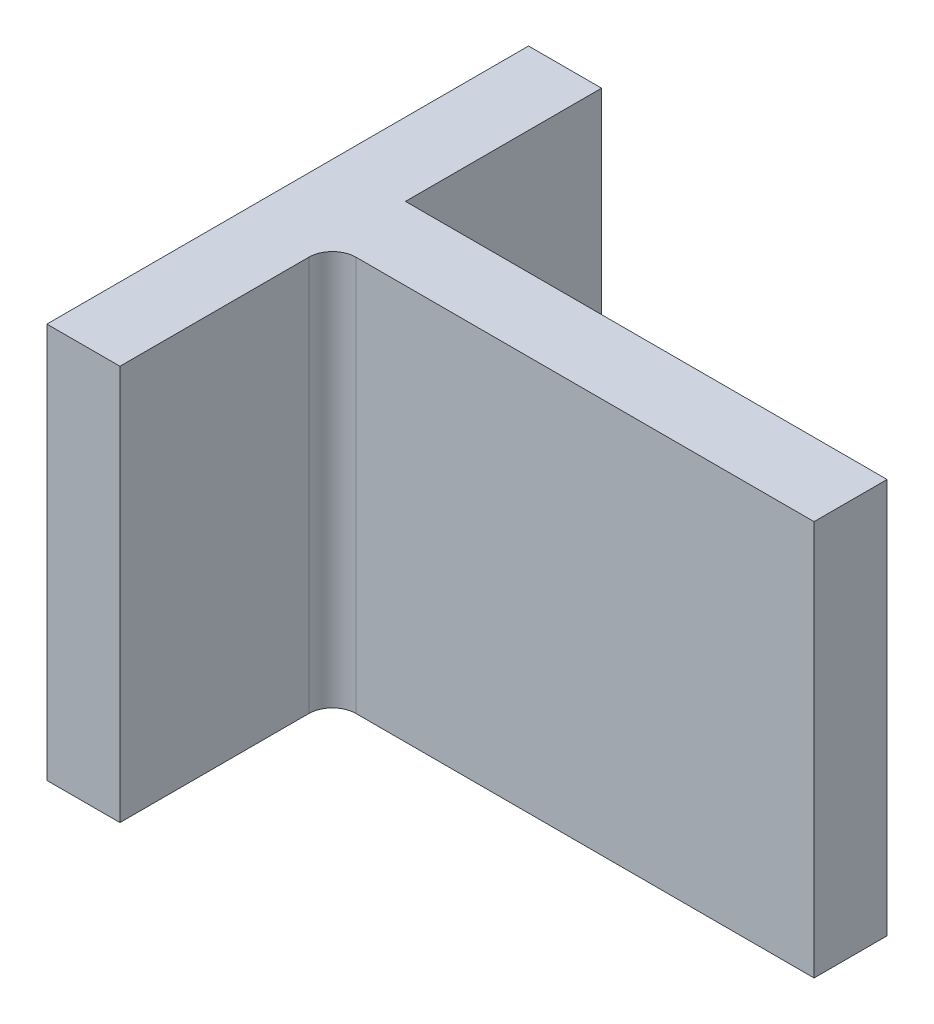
ISO-10303-21;
HEADER;
FILE_DESCRIPTION(('STEP AP214'),'2;1');
FILE_NAME('part.step','',(''),(''),'','','');
FILE_SCHEMA(('AUTOMOTIVE_DESIGN { 1 0 10303 214 1 1 1 1 }'));
ENDSEC;
DATA;
#1=APPLICATION_CONTEXT('core data for automotive mechanical design processes');
#2=APPLICATION_PROTOCOL_DEFINITION('international standard','automotive_design',2000,#1);
#3=PRODUCT_CONTEXT('',#1,'mechanical');
#4=PRODUCT('Part','Part','',(#3));
#5=PRODUCT_RELATED_PRODUCT_CATEGORY('part','',(#4));
#6=PRODUCT_DEFINITION_FORMATION('','',#4);
#7=PRODUCT_DEFINITION_CONTEXT('part definition',#1,'design');
#8=PRODUCT_DEFINITION('design','',#6,#7);
#9=PRODUCT_DEFINITION_SHAPE('','',#8);
#10=(LENGTH_UNIT() NAMED_UNIT(*) SI_UNIT(.MILLI.,.METRE.));
#11=(NAMED_UNIT(*) PLANE_ANGLE_UNIT() SI_UNIT($,.RADIAN.));
#12=(NAMED_UNIT(*) SI_UNIT($,.STERADIAN.) SOLID_ANGLE_UNIT());
#13=UNCERTAINTY_MEASURE_WITH_UNIT(LENGTH_MEASURE(1.E-05),#10,'distance_accuracy_value','');
#14=(GEOMETRIC_REPRESENTATION_CONTEXT(3) GLOBAL_UNCERTAINTY_ASSIGNED_CONTEXT((#13)) GLOBAL_UNIT_ASSIGNED_CONTEXT((#10,
#11,#12)) REPRESENTATION_CONTEXT('',''));
#15=CARTESIAN_POINT('',(0.,0.,0.));
#16=DIRECTION('',(0.,0.,1.));
#17=DIRECTION('',(1.,0.,0.));
#18=AXIS2_PLACEMENT_3D('',#15,#16,#17);
#19=CARTESIAN_POINT('',(15.469383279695,0.,102.));
#20=DIRECTION('',(-1.,0.,0.));
#21=DIRECTION('',(0.,0.,1.));
#22=AXIS2_PLACEMENT_3D('',#19,#20,#21);
#23=PLANE('',#22);
#24=DIRECTION('',(0.,0.,-1.));
#25=VECTOR('',#24,1.);
#26=CARTESIAN_POINT('',(15.469383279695,83.7000822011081,102.));
#27=LINE('',#26,#25);
#28=CARTESIAN_POINT('',(15.469383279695,83.7000822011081,41.530616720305));
#29=VERTEX_POINT('',#28);
#30=CARTESIAN_POINT('',(15.469383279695,83.7000822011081,0.));
#31=VERTEX_POINT('',#30);
#32=EDGE_CURVE('E123',#29,#31,#27,.T.);
#33=ORIENTED_EDGE('',*,*,#32,.F.);
#34=DIRECTION('',(0.,-1.,0.));
#35=VECTOR('',#34,1.);
#36=CARTESIAN_POINT('',(15.469383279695,0.,41.530616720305));
#37=LINE('',#36,#35);
#38=CARTESIAN_POINT('',(15.469383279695,0.,41.530616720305));
#39=VERTEX_POINT('',#38);
#40=EDGE_CURVE('E109',#29,#39,#37,.T.);
#41=ORIENTED_EDGE('',*,*,#40,.T.);
#42=DIRECTION('',(0.,0.,-1.));
#43=VECTOR('',#42,1.);
#44=CARTESIAN_POINT('',(15.469383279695,0.,102.));
#45=LINE('',#44,#43);
#46=CARTESIAN_POINT('',(15.469383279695,0.,0.));
#47=VERTEX_POINT('',#46);
#48=EDGE_CURVE('E121',#39,#47,#45,.T.);
#49=ORIENTED_EDGE('',*,*,#48,.T.);
#50=DIRECTION('',(0.,1.,0.));
#51=VECTOR('',#50,1.);
#52=CARTESIAN_POINT('',(15.469383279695,0.,0.));
#53=LINE('',#52,#51);
#54=EDGE_CURVE('E164',#47,#31,#53,.T.);
#55=ORIENTED_EDGE('',*,*,#54,.T.);
#56=EDGE_LOOP('',(#33,#41,#49,#55));
#57=FACE_BOUND('',#56,.T.);
#58=ADVANCED_FACE('F35',(#57),#23,.F.);
#59=CARTESIAN_POINT('',(0.,0.,102.));
#60=DIRECTION('',(1.,0.,0.));
#61=DIRECTION('',(0.,0.,-1.));
#62=AXIS2_PLACEMENT_3D('',#59,#60,#61);
#63=PLANE('',#62);
#64=DIRECTION('',(0.,-1.,0.));
#65=VECTOR('',#64,1.);
#66=CARTESIAN_POINT('',(0.,0.,0.));
#67=LINE('',#66,#65);
#68=CARTESIAN_POINT('',(0.,83.7000822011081,0.));
#69=VERTEX_POINT('',#68);
#70=CARTESIAN_POINT('',(0.,0.,0.));
#71=VERTEX_POINT('',#70);
#72=EDGE_CURVE('E116',#69,#71,#67,.T.);
#73=ORIENTED_EDGE('',*,*,#72,.T.);
#74=DIRECTION('',(0.,0.,-1.));
#75=VECTOR('',#74,1.);
#76=CARTESIAN_POINT('',(0.,0.,102.));
#77=LINE('',#76,#75);
#78=CARTESIAN_POINT('',(0.,0.,102.));
#79=VERTEX_POINT('',#78);
#80=EDGE_CURVE('E135',#79,#71,#77,.T.);
#81=ORIENTED_EDGE('',*,*,#80,.F.);
#82=DIRECTION('',(0.,-1.,0.));
#83=VECTOR('',#82,1.);
#84=CARTESIAN_POINT('',(0.,0.,102.));
#85=LINE('',#84,#83);
#86=CARTESIAN_POINT('',(0.,83.7000822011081,102.));
#87=VERTEX_POINT('',#86);
#88=EDGE_CURVE('E163',#87,#79,#85,.T.);
#89=ORIENTED_EDGE('',*,*,#88,.F.);
#90=DIRECTION('',(0.,0.,-1.));
#91=VECTOR('',#90,1.);
#92=CARTESIAN_POINT('',(0.,83.7000822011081,102.));
#93=LINE('',#92,#91);
#94=EDGE_CURVE('E150',#87,#69,#93,.T.);
#95=ORIENTED_EDGE('',*,*,#94,.T.);
#96=EDGE_LOOP('',(#73,#81,#89,#95));
#97=FACE_BOUND('',#96,.T.);
#98=ADVANCED_FACE('F211',(#97),#63,.F.);
#99=CARTESIAN_POINT('',(0.,0.,102.));
#100=DIRECTION('',(0.,1.,0.));
#101=DIRECTION('',(0.,0.,1.));
#102=AXIS2_PLACEMENT_3D('',#99,#100,#101);
#103=PLANE('',#102);
#104=DIRECTION('',(1.,0.,0.));
#105=VECTOR('',#104,1.);
#106=CARTESIAN_POINT('',(0.,0.,0.));
#107=LINE('',#106,#105);
#108=EDGE_CURVE('E129',#71,#47,#107,.T.);
#109=ORIENTED_EDGE('',*,*,#108,.T.);
#110=ORIENTED_EDGE('',*,*,#48,.F.);
#111=DIRECTION('',(1.,0.,0.));
#112=VECTOR('',#111,1.);
#113=CARTESIAN_POINT('',(15.469383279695,0.,41.530616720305));
#114=LINE('',#113,#112);
#115=CARTESIAN_POINT('',(117.469383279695,0.,41.530616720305));
#116=VERTEX_POINT('',#115);
#117=EDGE_CURVE('E105',#39,#116,#114,.T.);
#118=ORIENTED_EDGE('',*,*,#117,.T.);
#119=DIRECTION('',(0.,0.,1.));
#120=VECTOR('',#119,1.);
#121=CARTESIAN_POINT('',(117.469383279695,0.,41.530616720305));
#122=LINE('',#121,#120);
#123=CARTESIAN_POINT('',(117.469383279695,0.,57.));
#124=VERTEX_POINT('',#123);
#125=EDGE_CURVE('E177',#116,#124,#122,.T.);
#126=ORIENTED_EDGE('',*,*,#125,.T.);
#127=DIRECTION('',(1.,0.,0.));
#128=VECTOR('',#127,1.);
#129=CARTESIAN_POINT('',(15.469383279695,0.,57.));
#130=LINE('',#129,#128);
#131=CARTESIAN_POINT('',(20.469383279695,0.,57.));
#132=VERTEX_POINT('',#131);
#133=EDGE_CURVE('E117',#132,#124,#130,.T.);
#134=ORIENTED_EDGE('',*,*,#133,.F.);
#135=CARTESIAN_POINT('',(20.469383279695,0.,62.));
#136=DIRECTION('',(0.,1.,0.));
#137=DIRECTION('',(0.,0.,1.));
#138=AXIS2_PLACEMENT_3D('',#135,#136,#137);
#139=CIRCLE('',#138,5.);
#140=CARTESIAN_POINT('',(15.469383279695,0.,62.));
#141=VERTEX_POINT('',#140);
#142=EDGE_CURVE('E11',#132,#141,#139,.T.);
#143=ORIENTED_EDGE('',*,*,#142,.T.);
#144=CARTESIAN_POINT('',(15.469383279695,0.,102.));
#145=VERTEX_POINT('',#144);
#146=EDGE_CURVE('E131',#145,#141,#45,.T.);
#147=ORIENTED_EDGE('',*,*,#146,.F.);
#148=DIRECTION('',(1.,0.,0.));
#149=VECTOR('',#148,1.);
#150=CARTESIAN_POINT('',(0.,0.,102.));
#151=LINE('',#150,#149);
#152=EDGE_CURVE('E169',#79,#145,#151,.T.);
#153=ORIENTED_EDGE('',*,*,#152,.F.);
#154=ORIENTED_EDGE('',*,*,#80,.T.);
#155=EDGE_LOOP('',(#109,#110,#118,#126,#134,#143,#147,#153,#154));
#156=FACE_BOUND('',#155,.T.);
#157=ADVANCED_FACE('F127',(#156),#103,.F.);
#158=ORIENTED_EDGE('',*,*,#146,.T.);
#159=DIRECTION('',(0.,1.,0.));
#160=VECTOR('',#159,1.);
#161=CARTESIAN_POINT('',(15.469383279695,83.7000822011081,62.));
#162=LINE('',#161,#160);
#163=CARTESIAN_POINT('',(15.469383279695,83.7000822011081,62.));
#164=VERTEX_POINT('',#163);
#165=EDGE_CURVE('E149',#141,#164,#162,.T.);
#166=ORIENTED_EDGE('',*,*,#165,.T.);
#167=CARTESIAN_POINT('',(15.469383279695,83.7000822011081,102.));
#168=VERTEX_POINT('',#167);
#169=EDGE_CURVE('E132',#168,#164,#27,.T.);
#170=ORIENTED_EDGE('',*,*,#169,.F.);
#171=DIRECTION('',(0.,1.,0.));
#172=VECTOR('',#171,1.);
#173=CARTESIAN_POINT('',(15.469383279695,0.,102.));
#174=LINE('',#173,#172);
#175=EDGE_CURVE('E158',#145,#168,#174,.T.);
#176=ORIENTED_EDGE('',*,*,#175,.F.);
#177=EDGE_LOOP('',(#158,#166,#170,#176));
#178=FACE_BOUND('',#177,.T.);
#179=ADVANCED_FACE('F205',(#178),#23,.F.);
#180=CARTESIAN_POINT('',(0.,83.7000822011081,102.));
#181=DIRECTION('',(0.,-1.,0.));
#182=DIRECTION('',(0.,0.,-1.));
#183=AXIS2_PLACEMENT_3D('',#180,#181,#182);
#184=PLANE('',#183);
#185=DIRECTION('',(-1.,0.,0.));
#186=VECTOR('',#185,1.);
#187=CARTESIAN_POINT('',(0.,83.7000822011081,0.));
#188=LINE('',#187,#186);
#189=EDGE_CURVE('E161',#31,#69,#188,.T.);
#190=ORIENTED_EDGE('',*,*,#189,.T.);
#191=ORIENTED_EDGE('',*,*,#94,.F.);
#192=DIRECTION('',(-1.,0.,0.));
#193=VECTOR('',#192,1.);
#194=CARTESIAN_POINT('',(0.,83.7000822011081,102.));
#195=LINE('',#194,#193);
#196=EDGE_CURVE('E152',#168,#87,#195,.T.);
#197=ORIENTED_EDGE('',*,*,#196,.F.);
#198=ORIENTED_EDGE('',*,*,#169,.T.);
#199=CARTESIAN_POINT('',(20.469383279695,83.7000822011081,62.));
#200=DIRECTION('',(0.,-1.,0.));
#201=DIRECTION('',(0.,0.,-1.));
#202=AXIS2_PLACEMENT_3D('',#199,#200,#201);
#203=CIRCLE('',#202,5.);
#204=CARTESIAN_POINT('',(20.469383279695,83.7000822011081,57.));
#205=VERTEX_POINT('',#204);
#206=EDGE_CURVE('E43',#164,#205,#203,.T.);
#207=ORIENTED_EDGE('',*,*,#206,.T.);
#208=DIRECTION('',(1.,0.,0.));
#209=VECTOR('',#208,1.);
#210=CARTESIAN_POINT('',(15.469383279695,83.7000822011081,57.));
#211=LINE('',#210,#209);
#212=CARTESIAN_POINT('',(117.469383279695,83.7000822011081,57.));
#213=VERTEX_POINT('',#212);
#214=EDGE_CURVE('E186',#205,#213,#211,.T.);
#215=ORIENTED_EDGE('',*,*,#214,.T.);
#216=DIRECTION('',(0.,0.,-1.));
#217=VECTOR('',#216,1.);
#218=CARTESIAN_POINT('',(117.469383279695,83.7000822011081,41.530616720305));
#219=LINE('',#218,#217);
#220=CARTESIAN_POINT('',(117.469383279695,83.7000822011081,41.530616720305));
#221=VERTEX_POINT('',#220);
#222=EDGE_CURVE('E125',#213,#221,#219,.T.);
#223=ORIENTED_EDGE('',*,*,#222,.T.);
#224=DIRECTION('',(1.,0.,0.));
#225=VECTOR('',#224,1.);
#226=CARTESIAN_POINT('',(15.469383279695,83.7000822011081,41.530616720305));
#227=LINE('',#226,#225);
#228=EDGE_CURVE('E124',#29,#221,#227,.T.);
#229=ORIENTED_EDGE('',*,*,#228,.F.);
#230=ORIENTED_EDGE('',*,*,#32,.T.);
#231=EDGE_LOOP('',(#190,#191,#197,#198,#207,#215,#223,#229,#230));
#232=FACE_BOUND('',#231,.T.);
#233=ADVANCED_FACE('F199',(#232),#184,.F.);
#234=CARTESIAN_POINT('',(0.,83.7000822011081,102.));
#235=DIRECTION('',(0.,0.,-1.));
#236=DIRECTION('',(-1.,0.,0.));
#237=AXIS2_PLACEMENT_3D('',#234,#235,#236);
#238=PLANE('',#237);
#239=ORIENTED_EDGE('',*,*,#88,.T.);
#240=ORIENTED_EDGE('',*,*,#152,.T.);
#241=ORIENTED_EDGE('',*,*,#175,.T.);
#242=ORIENTED_EDGE('',*,*,#196,.T.);
#243=EDGE_LOOP('',(#239,#240,#241,#242));
#244=FACE_BOUND('',#243,.T.);
#245=ADVANCED_FACE('F209',(#244),#238,.F.);
#246=CARTESIAN_POINT('',(0.,83.7000822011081,0.));
#247=DIRECTION('',(0.,0.,-1.));
#248=DIRECTION('',(-1.,0.,0.));
#249=AXIS2_PLACEMENT_3D('',#246,#247,#248);
#250=PLANE('',#249);
#251=ORIENTED_EDGE('',*,*,#72,.F.);
#252=ORIENTED_EDGE('',*,*,#189,.F.);
#253=ORIENTED_EDGE('',*,*,#54,.F.);
#254=ORIENTED_EDGE('',*,*,#108,.F.);
#255=EDGE_LOOP('',(#251,#252,#253,#254));
#256=FACE_BOUND('',#255,.T.);
#257=ADVANCED_FACE('F214',(#256),#250,.T.);
#258=CARTESIAN_POINT('',(15.469383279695,0.,41.530616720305));
#259=DIRECTION('',(0.,0.,1.));
#260=DIRECTION('',(1.,0.,0.));
#261=AXIS2_PLACEMENT_3D('',#258,#259,#260);
#262=PLANE('',#261);
#263=DIRECTION('',(0.,-1.,0.));
#264=VECTOR('',#263,1.);
#265=CARTESIAN_POINT('',(117.469383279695,0.,41.530616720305));
#266=LINE('',#265,#264);
#267=EDGE_CURVE('E112',#221,#116,#266,.T.);
#268=ORIENTED_EDGE('',*,*,#267,.T.);
#269=ORIENTED_EDGE('',*,*,#117,.F.);
#270=ORIENTED_EDGE('',*,*,#40,.F.);
#271=ORIENTED_EDGE('',*,*,#228,.T.);
#272=EDGE_LOOP('',(#268,#269,#270,#271));
#273=FACE_BOUND('',#272,.T.);
#274=ADVANCED_FACE('F107',(#273),#262,.F.);
#275=CARTESIAN_POINT('',(15.469383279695,0.,57.));
#276=DIRECTION('',(0.,0.,-1.));
#277=DIRECTION('',(-1.,0.,0.));
#278=AXIS2_PLACEMENT_3D('',#275,#276,#277);
#279=PLANE('',#278);
#280=ORIENTED_EDGE('',*,*,#214,.F.);
#281=DIRECTION('',(0.,1.,0.));
#282=VECTOR('',#281,1.);
#283=CARTESIAN_POINT('',(20.469383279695,0.,57.));
#284=LINE('',#283,#282);
#285=EDGE_CURVE('E50',#205,#132,#284,.F.);
#286=ORIENTED_EDGE('',*,*,#285,.T.);
#287=ORIENTED_EDGE('',*,*,#133,.T.);
#288=DIRECTION('',(0.,1.,0.));
#289=VECTOR('',#288,1.);
#290=CARTESIAN_POINT('',(117.469383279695,0.,57.));
#291=LINE('',#290,#289);
#292=EDGE_CURVE('E174',#124,#213,#291,.T.);
#293=ORIENTED_EDGE('',*,*,#292,.T.);
#294=EDGE_LOOP('',(#280,#286,#287,#293));
#295=FACE_BOUND('',#294,.T.);
#296=ADVANCED_FACE('F193',(#295),#279,.F.);
#297=CARTESIAN_POINT('',(117.469383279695,83.7000822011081,41.530616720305));
#298=DIRECTION('',(1.,0.,0.));
#299=DIRECTION('',(0.,0.,-1.));
#300=AXIS2_PLACEMENT_3D('',#297,#298,#299);
#301=PLANE('',#300);
#302=ORIENTED_EDGE('',*,*,#267,.F.);
#303=ORIENTED_EDGE('',*,*,#222,.F.);
#304=ORIENTED_EDGE('',*,*,#292,.F.);
#305=ORIENTED_EDGE('',*,*,#125,.F.);
#306=EDGE_LOOP('',(#302,#303,#304,#305));
#307=FACE_BOUND('',#306,.T.);
#308=ADVANCED_FACE('F198',(#307),#301,.T.);
#309=CARTESIAN_POINT('',(20.469383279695,0.,62.));
#310=DIRECTION('',(0.,-1.,0.));
#311=DIRECTION('',(0.,0.,-1.));
#312=AXIS2_PLACEMENT_3D('',#309,#310,#311);
#313=CYLINDRICAL_SURFACE('',#312,5.);
#314=ORIENTED_EDGE('',*,*,#142,.F.);
#315=ORIENTED_EDGE('',*,*,#285,.F.);
#316=ORIENTED_EDGE('',*,*,#206,.F.);
#317=ORIENTED_EDGE('',*,*,#165,.F.);
#318=EDGE_LOOP('',(#314,#315,#316,#317));
#319=FACE_BOUND('',#318,.T.);
#320=ADVANCED_FACE('F37',(#319),#313,.F.);
#321=CLOSED_SHELL('',(#58,#98,#157,#179,#233,#245,#257,#274,#296,#308,#320));
#322=MANIFOLD_SOLID_BREP('B2',#321);
#323=ADVANCED_BREP_SHAPE_REPRESENTATION('',(#18,#322),#14);
#324=SHAPE_DEFINITION_REPRESENTATION(#9,#323);
ENDSEC;
END-ISO-10303-21;
